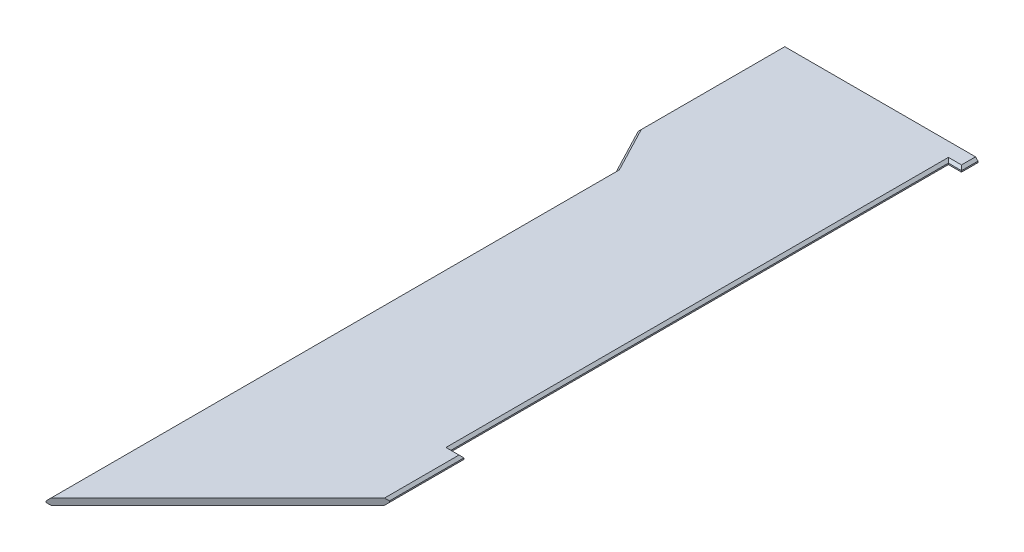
ISO-10303-21;
HEADER;
FILE_DESCRIPTION(('STEP AP214'),'2;1');
FILE_NAME('part.step','',(''),(''),'','','');
FILE_SCHEMA(('AUTOMOTIVE_DESIGN { 1 0 10303 214 1 1 1 1 }'));
ENDSEC;
DATA;
#1=APPLICATION_CONTEXT('core data for automotive mechanical design processes');
#2=APPLICATION_PROTOCOL_DEFINITION('international standard','automotive_design',2000,#1);
#3=PRODUCT_CONTEXT('',#1,'mechanical');
#4=PRODUCT('Part','Part','',(#3));
#5=PRODUCT_RELATED_PRODUCT_CATEGORY('part','',(#4));
#6=PRODUCT_DEFINITION_FORMATION('','',#4);
#7=PRODUCT_DEFINITION_CONTEXT('part definition',#1,'design');
#8=PRODUCT_DEFINITION('design','',#6,#7);
#9=PRODUCT_DEFINITION_SHAPE('','',#8);
#10=(LENGTH_UNIT() NAMED_UNIT(*) SI_UNIT(.MILLI.,.METRE.));
#11=(NAMED_UNIT(*) PLANE_ANGLE_UNIT() SI_UNIT($,.RADIAN.));
#12=(NAMED_UNIT(*) SI_UNIT($,.STERADIAN.) SOLID_ANGLE_UNIT());
#13=UNCERTAINTY_MEASURE_WITH_UNIT(LENGTH_MEASURE(1.E-05),#10,'distance_accuracy_value','');
#14=(GEOMETRIC_REPRESENTATION_CONTEXT(3) GLOBAL_UNCERTAINTY_ASSIGNED_CONTEXT((#13)) GLOBAL_UNIT_ASSIGNED_CONTEXT((#10,
#11,#12)) REPRESENTATION_CONTEXT('',''));
#15=CARTESIAN_POINT('',(0.,0.,0.));
#16=DIRECTION('',(0.,0.,1.));
#17=DIRECTION('',(1.,0.,0.));
#18=AXIS2_PLACEMENT_3D('',#15,#16,#17);
#19=CARTESIAN_POINT('',(552.551731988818,19.05,994.453846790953));
#20=DIRECTION('',(0.,0.,1.));
#21=DIRECTION('',(1.,0.,0.));
#22=AXIS2_PLACEMENT_3D('',#19,#20,#21);
#23=PLANE('',#22);
#24=DIRECTION('',(0.,-1.,0.));
#25=VECTOR('',#24,1.);
#26=CARTESIAN_POINT('',(552.551731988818,19.05,994.453846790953));
#27=LINE('',#26,#25);
#28=CARTESIAN_POINT('',(552.551731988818,4.04999999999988,994.453846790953));
#29=VERTEX_POINT('',#28);
#30=CARTESIAN_POINT('',(552.551731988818,-4.04999999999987,994.453846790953));
#31=VERTEX_POINT('',#30);
#32=EDGE_CURVE('E395',#29,#31,#27,.T.);
#33=ORIENTED_EDGE('',*,*,#32,.T.);
#34=DIRECTION('',(-1.,0.,0.));
#35=VECTOR('',#34,1.);
#36=CARTESIAN_POINT('',(473.351731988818,-4.04999999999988,994.453846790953));
#37=LINE('',#36,#35);
#38=CARTESIAN_POINT('',(473.351731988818,-4.04999999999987,994.453846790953));
#39=VERTEX_POINT('',#38);
#40=EDGE_CURVE('E329',#31,#39,#37,.T.);
#41=ORIENTED_EDGE('',*,*,#40,.T.);
#42=DIRECTION('',(0.,-1.,0.));
#43=VECTOR('',#42,1.);
#44=CARTESIAN_POINT('',(473.351731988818,19.05,994.453846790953));
#45=LINE('',#44,#43);
#46=CARTESIAN_POINT('',(473.351731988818,4.04999999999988,994.453846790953));
#47=VERTEX_POINT('',#46);
#48=EDGE_CURVE('E218',#47,#39,#45,.T.);
#49=ORIENTED_EDGE('',*,*,#48,.F.);
#50=DIRECTION('',(1.,0.,0.));
#51=VECTOR('',#50,1.);
#52=CARTESIAN_POINT('',(552.551731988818,4.04999999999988,994.453846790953));
#53=LINE('',#52,#51);
#54=EDGE_CURVE('E72',#47,#29,#53,.T.);
#55=ORIENTED_EDGE('',*,*,#54,.T.);
#56=EDGE_LOOP('',(#33,#41,#49,#55));
#57=FACE_BOUND('',#56,.T.);
#58=ADVANCED_FACE('F50',(#57),#23,.F.);
#59=CARTESIAN_POINT('',(473.351731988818,19.05,994.453846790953));
#60=DIRECTION('',(-1.,0.,0.));
#61=DIRECTION('',(0.,0.,1.));
#62=AXIS2_PLACEMENT_3D('',#59,#60,#61);
#63=PLANE('',#62);
#64=ORIENTED_EDGE('',*,*,#48,.T.);
#65=DIRECTION('',(0.,0.,-1.));
#66=VECTOR('',#65,1.);
#67=CARTESIAN_POINT('',(473.351731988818,-4.04999999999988,-2017.54615320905));
#68=LINE('',#67,#66);
#69=CARTESIAN_POINT('',(473.351731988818,-4.04999999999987,-2017.54615320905));
#70=VERTEX_POINT('',#69);
#71=EDGE_CURVE('E324',#39,#70,#68,.T.);
#72=ORIENTED_EDGE('',*,*,#71,.T.);
#73=DIRECTION('',(0.,-1.,0.));
#74=VECTOR('',#73,1.);
#75=CARTESIAN_POINT('',(473.351731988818,19.05,-2017.54615320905));
#76=LINE('',#75,#74);
#77=CARTESIAN_POINT('',(473.351731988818,4.04999999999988,-2017.54615320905));
#78=VERTEX_POINT('',#77);
#79=EDGE_CURVE('E227',#78,#70,#76,.T.);
#80=ORIENTED_EDGE('',*,*,#79,.F.);
#81=DIRECTION('',(0.,0.,1.));
#82=VECTOR('',#81,1.);
#83=CARTESIAN_POINT('',(473.351731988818,4.04999999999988,994.453846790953));
#84=LINE('',#83,#82);
#85=EDGE_CURVE('E325',#78,#47,#84,.T.);
#86=ORIENTED_EDGE('',*,*,#85,.T.);
#87=EDGE_LOOP('',(#64,#72,#80,#86));
#88=FACE_BOUND('',#87,.T.);
#89=ADVANCED_FACE('F463',(#88),#63,.F.);
#90=CARTESIAN_POINT('',(473.351731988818,19.05,-2017.54615320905));
#91=DIRECTION('',(0.,0.,-1.));
#92=DIRECTION('',(-1.,0.,0.));
#93=AXIS2_PLACEMENT_3D('',#90,#91,#92);
#94=PLANE('',#93);
#95=ORIENTED_EDGE('',*,*,#79,.T.);
#96=DIRECTION('',(1.,0.,0.));
#97=VECTOR('',#96,1.);
#98=CARTESIAN_POINT('',(552.551731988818,-4.04999999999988,-2017.54615320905));
#99=LINE('',#98,#97);
#100=CARTESIAN_POINT('',(552.551731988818,-4.04999999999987,-2017.54615320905));
#101=VERTEX_POINT('',#100);
#102=EDGE_CURVE('E317',#70,#101,#99,.T.);
#103=ORIENTED_EDGE('',*,*,#102,.T.);
#104=DIRECTION('',(0.,-1.,0.));
#105=VECTOR('',#104,1.);
#106=CARTESIAN_POINT('',(552.551731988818,19.05,-2017.54615320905));
#107=LINE('',#106,#105);
#108=CARTESIAN_POINT('',(552.551731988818,4.04999999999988,-2017.54615320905));
#109=VERTEX_POINT('',#108);
#110=EDGE_CURVE('E413',#109,#101,#107,.T.);
#111=ORIENTED_EDGE('',*,*,#110,.F.);
#112=DIRECTION('',(-1.,0.,0.));
#113=VECTOR('',#112,1.);
#114=CARTESIAN_POINT('',(473.351731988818,4.04999999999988,-2017.54615320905));
#115=LINE('',#114,#113);
#116=EDGE_CURVE('E316',#109,#78,#115,.T.);
#117=ORIENTED_EDGE('',*,*,#116,.T.);
#118=EDGE_LOOP('',(#95,#103,#111,#117));
#119=FACE_BOUND('',#118,.T.);
#120=ADVANCED_FACE('F421',(#119),#94,.F.);
#121=CARTESIAN_POINT('',(552.551731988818,19.05,-2017.54615320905));
#122=DIRECTION('',(-1.,0.,0.));
#123=DIRECTION('',(0.,0.,1.));
#124=AXIS2_PLACEMENT_3D('',#121,#122,#123);
#125=PLANE('',#124);
#126=ORIENTED_EDGE('',*,*,#110,.T.);
#127=DIRECTION('',(0.,0.,-1.));
#128=VECTOR('',#127,1.);
#129=CARTESIAN_POINT('',(552.551731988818,-4.04999999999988,-2117.54615320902));
#130=LINE('',#129,#128);
#131=CARTESIAN_POINT('',(552.551731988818,-4.04999999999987,-2117.54615320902));
#132=VERTEX_POINT('',#131);
#133=EDGE_CURVE('E315',#101,#132,#130,.T.);
#134=ORIENTED_EDGE('',*,*,#133,.T.);
#135=DIRECTION('',(0.,-1.,0.));
#136=VECTOR('',#135,1.);
#137=CARTESIAN_POINT('',(552.551731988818,19.05,-2117.54615320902));
#138=LINE('',#137,#136);
#139=CARTESIAN_POINT('',(552.551731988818,4.04999999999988,-2117.54615320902));
#140=VERTEX_POINT('',#139);
#141=EDGE_CURVE('E412',#140,#132,#138,.T.);
#142=ORIENTED_EDGE('',*,*,#141,.F.);
#143=DIRECTION('',(0.,0.,1.));
#144=VECTOR('',#143,1.);
#145=CARTESIAN_POINT('',(552.551731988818,4.04999999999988,-2017.54615320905));
#146=LINE('',#145,#144);
#147=EDGE_CURVE('E310',#140,#109,#146,.T.);
#148=ORIENTED_EDGE('',*,*,#147,.T.);
#149=EDGE_LOOP('',(#126,#134,#142,#148));
#150=FACE_BOUND('',#149,.T.);
#151=ADVANCED_FACE('F445',(#150),#125,.F.);
#152=CARTESIAN_POINT('',(552.551731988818,19.05,-2117.54615320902));
#153=DIRECTION('',(0.,0.,1.));
#154=DIRECTION('',(1.,0.,0.));
#155=AXIS2_PLACEMENT_3D('',#152,#153,#154);
#156=PLANE('',#155);
#157=DIRECTION('',(-1.,0.,0.));
#158=VECTOR('',#157,1.);
#159=CARTESIAN_POINT('',(552.551731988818,-19.05,-2117.54615320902));
#160=LINE('',#159,#158);
#161=CARTESIAN_POINT('',(537.551731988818,-19.05,-2117.54615320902));
#162=VERTEX_POINT('',#161);
#163=CARTESIAN_POINT('',(-617.248268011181,-19.05,-2117.54615320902));
#164=VERTEX_POINT('',#163);
#165=EDGE_CURVE('E341',#162,#164,#160,.T.);
#166=ORIENTED_EDGE('',*,*,#165,.T.);
#167=DIRECTION('',(-0.707106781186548,0.707106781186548,0.));
#168=VECTOR('',#167,1.);
#169=CARTESIAN_POINT('',(-632.248268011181,-4.04999999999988,-2117.54615320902));
#170=LINE('',#169,#168);
#171=CARTESIAN_POINT('',(-632.248268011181,-4.04999999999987,-2117.54615320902));
#172=VERTEX_POINT('',#171);
#173=EDGE_CURVE('E282',#164,#172,#170,.T.);
#174=ORIENTED_EDGE('',*,*,#173,.T.);
#175=DIRECTION('',(0.,-1.,0.));
#176=VECTOR('',#175,1.);
#177=CARTESIAN_POINT('',(-632.248268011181,19.05,-2117.54615320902));
#178=LINE('',#177,#176);
#179=CARTESIAN_POINT('',(-632.248268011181,4.04999999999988,-2117.54615320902));
#180=VERTEX_POINT('',#179);
#181=EDGE_CURVE('E410',#180,#172,#178,.T.);
#182=ORIENTED_EDGE('',*,*,#181,.F.);
#183=DIRECTION('',(-0.707106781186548,-0.707106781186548,0.));
#184=VECTOR('',#183,1.);
#185=CARTESIAN_POINT('',(-617.248268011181,19.05,-2117.54615320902));
#186=LINE('',#185,#184);
#187=CARTESIAN_POINT('',(-617.248268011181,19.05,-2117.54615320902));
#188=VERTEX_POINT('',#187);
#189=EDGE_CURVE('E279',#180,#188,#186,.F.);
#190=ORIENTED_EDGE('',*,*,#189,.T.);
#191=DIRECTION('',(-1.,0.,0.));
#192=VECTOR('',#191,1.);
#193=CARTESIAN_POINT('',(552.551731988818,19.05,-2117.54615320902));
#194=LINE('',#193,#192);
#195=CARTESIAN_POINT('',(537.551731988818,19.05,-2117.54615320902));
#196=VERTEX_POINT('',#195);
#197=EDGE_CURVE('E446',#196,#188,#194,.T.);
#198=ORIENTED_EDGE('',*,*,#197,.F.);
#199=DIRECTION('',(-0.707106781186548,0.707106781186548,0.));
#200=VECTOR('',#199,1.);
#201=CARTESIAN_POINT('',(537.551731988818,19.05,-2117.54615320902));
#202=LINE('',#201,#200);
#203=EDGE_CURVE('E275',#196,#140,#202,.F.);
#204=ORIENTED_EDGE('',*,*,#203,.T.);
#205=ORIENTED_EDGE('',*,*,#141,.T.);
#206=DIRECTION('',(-0.707106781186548,-0.707106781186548,0.));
#207=VECTOR('',#206,1.);
#208=CARTESIAN_POINT('',(552.551731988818,-4.04999999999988,-2117.54615320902));
#209=LINE('',#208,#207);
#210=EDGE_CURVE('E274',#132,#162,#209,.T.);
#211=ORIENTED_EDGE('',*,*,#210,.T.);
#212=EDGE_LOOP('',(#166,#174,#182,#190,#198,#204,#205,#211));
#213=FACE_BOUND('',#212,.T.);
#214=ADVANCED_FACE('F447',(#213),#156,.F.);
#215=CARTESIAN_POINT('',(-632.248268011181,19.05,-2117.54615320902));
#216=DIRECTION('',(1.,0.,0.));
#217=DIRECTION('',(0.,0.,-1.));
#218=AXIS2_PLACEMENT_3D('',#215,#216,#217);
#219=PLANE('',#218);
#220=ORIENTED_EDGE('',*,*,#181,.T.);
#221=DIRECTION('',(0.,0.,1.));
#222=VECTOR('',#221,1.);
#223=CARTESIAN_POINT('',(-632.248268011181,-4.04999999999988,-1245.01955496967));
#224=LINE('',#223,#222);
#225=CARTESIAN_POINT('',(-632.248268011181,-4.04999999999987,-1245.01955496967));
#226=VERTEX_POINT('',#225);
#227=EDGE_CURVE('E267',#172,#226,#224,.T.);
#228=ORIENTED_EDGE('',*,*,#227,.T.);
#229=DIRECTION('',(0.,-1.,0.));
#230=VECTOR('',#229,1.);
#231=CARTESIAN_POINT('',(-632.248268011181,19.05,-1245.01955496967));
#232=LINE('',#231,#230);
#233=CARTESIAN_POINT('',(-632.248268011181,4.04999999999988,-1245.01955496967));
#234=VERTEX_POINT('',#233);
#235=EDGE_CURVE('E401',#234,#226,#232,.T.);
#236=ORIENTED_EDGE('',*,*,#235,.F.);
#237=DIRECTION('',(0.,0.,-1.));
#238=VECTOR('',#237,1.);
#239=CARTESIAN_POINT('',(-632.248268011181,4.04999999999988,-2117.54615320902));
#240=LINE('',#239,#238);
#241=EDGE_CURVE('E266',#234,#180,#240,.T.);
#242=ORIENTED_EDGE('',*,*,#241,.T.);
#243=EDGE_LOOP('',(#220,#228,#236,#242));
#244=FACE_BOUND('',#243,.T.);
#245=ADVANCED_FACE('F689',(#244),#219,.F.);
#246=CARTESIAN_POINT('',(-487.06076801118,19.05,-967.229254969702));
#247=DIRECTION('',(0.886253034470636,0.,-0.463201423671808));
#248=DIRECTION('',(-0.463201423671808,0.,-0.886253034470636));
#249=AXIS2_PLACEMENT_3D('',#246,#247,#248);
#250=PLANE('',#249);
#251=ORIENTED_EDGE('',*,*,#235,.T.);
#252=DIRECTION('',(0.463201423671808,0.,0.886253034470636));
#253=VECTOR('',#252,1.);
#254=CARTESIAN_POINT('',(-487.06076801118,-4.04999999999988,-967.229254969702));
#255=LINE('',#254,#253);
#256=CARTESIAN_POINT('',(-487.06076801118,-4.04999999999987,-967.229254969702));
#257=VERTEX_POINT('',#256);
#258=EDGE_CURVE('E263',#226,#257,#255,.T.);
#259=ORIENTED_EDGE('',*,*,#258,.T.);
#260=DIRECTION('',(0.,-1.,0.));
#261=VECTOR('',#260,1.);
#262=CARTESIAN_POINT('',(-487.06076801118,19.05,-967.229254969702));
#263=LINE('',#262,#261);
#264=CARTESIAN_POINT('',(-487.06076801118,4.04999999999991,-967.229254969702));
#265=VERTEX_POINT('',#264);
#266=EDGE_CURVE('E211',#265,#257,#263,.T.);
#267=ORIENTED_EDGE('',*,*,#266,.F.);
#268=DIRECTION('',(-0.463201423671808,0.,-0.886253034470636));
#269=VECTOR('',#268,1.);
#270=CARTESIAN_POINT('',(-487.06076801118,4.04999999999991,-967.229254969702));
#271=LINE('',#270,#269);
#272=EDGE_CURVE('E257',#265,#234,#271,.T.);
#273=ORIENTED_EDGE('',*,*,#272,.T.);
#274=EDGE_LOOP('',(#251,#259,#267,#273));
#275=FACE_BOUND('',#274,.T.);
#276=ADVANCED_FACE('F679',(#275),#250,.F.);
#277=CARTESIAN_POINT('',(-487.06076801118,19.05,2485.26634679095));
#278=DIRECTION('',(1.,0.,0.));
#279=DIRECTION('',(0.,0.,-1.));
#280=AXIS2_PLACEMENT_3D('',#277,#278,#279);
#281=PLANE('',#280);
#282=ORIENTED_EDGE('',*,*,#266,.T.);
#283=DIRECTION('',(0.,0.,1.));
#284=VECTOR('',#283,1.);
#285=CARTESIAN_POINT('',(-487.06076801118,-4.04999999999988,2485.26634679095));
#286=LINE('',#285,#284);
#287=CARTESIAN_POINT('',(-487.06076801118,-4.04999999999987,2485.26634679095));
#288=VERTEX_POINT('',#287);
#289=EDGE_CURVE('E207',#257,#288,#286,.T.);
#290=ORIENTED_EDGE('',*,*,#289,.T.);
#291=DIRECTION('',(0.,-1.,0.));
#292=VECTOR('',#291,1.);
#293=CARTESIAN_POINT('',(-487.06076801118,19.05,2485.26634679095));
#294=LINE('',#293,#292);
#295=CARTESIAN_POINT('',(-487.06076801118,4.04999999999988,2485.26634679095));
#296=VERTEX_POINT('',#295);
#297=EDGE_CURVE('E192',#296,#288,#294,.T.);
#298=ORIENTED_EDGE('',*,*,#297,.F.);
#299=DIRECTION('',(0.,0.,-1.));
#300=VECTOR('',#299,1.);
#301=CARTESIAN_POINT('',(-487.06076801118,4.04999999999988,2485.26634679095));
#302=LINE('',#301,#300);
#303=EDGE_CURVE('E206',#296,#265,#302,.T.);
#304=ORIENTED_EDGE('',*,*,#303,.T.);
#305=EDGE_LOOP('',(#282,#290,#298,#304));
#306=FACE_BOUND('',#305,.T.);
#307=ADVANCED_FACE('F202',(#306),#281,.F.);
#308=CARTESIAN_POINT('',(552.551731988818,19.05,1445.65384679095));
#309=DIRECTION('',(-0.707106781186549,0.,-0.707106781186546));
#310=DIRECTION('',(-0.707106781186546,0.,0.707106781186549));
#311=AXIS2_PLACEMENT_3D('',#308,#309,#310);
#312=PLANE('',#311);
#313=ORIENTED_EDGE('',*,*,#297,.T.);
#314=DIRECTION('',(0.577350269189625,-0.577350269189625,-0.577350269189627));
#315=VECTOR('',#314,1.);
#316=CARTESIAN_POINT('',(-487.060768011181,-4.04999999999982,2485.26634679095));
#317=LINE('',#316,#315);
#318=CARTESIAN_POINT('',(-472.06076801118,-19.05,2470.26634679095));
#319=VERTEX_POINT('',#318);
#320=EDGE_CURVE('E200',#288,#319,#317,.T.);
#321=ORIENTED_EDGE('',*,*,#320,.T.);
#322=DIRECTION('',(0.707106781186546,0.,-0.707106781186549));
#323=VECTOR('',#322,1.);
#324=CARTESIAN_POINT('',(552.551731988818,-19.05,1445.65384679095));
#325=LINE('',#324,#323);
#326=CARTESIAN_POINT('',(537.551731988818,-19.05,1460.65384679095));
#327=VERTEX_POINT('',#326);
#328=EDGE_CURVE('E765',#319,#327,#325,.T.);
#329=ORIENTED_EDGE('',*,*,#328,.T.);
#330=DIRECTION('',(0.577350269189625,0.577350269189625,-0.577350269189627));
#331=VECTOR('',#330,1.);
#332=CARTESIAN_POINT('',(552.551731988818,-4.04999999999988,1445.65384679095));
#333=LINE('',#332,#331);
#334=CARTESIAN_POINT('',(552.551731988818,-4.04999999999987,1445.65384679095));
#335=VERTEX_POINT('',#334);
#336=EDGE_CURVE('E199',#327,#335,#333,.T.);
#337=ORIENTED_EDGE('',*,*,#336,.T.);
#338=DIRECTION('',(0.,-1.,0.));
#339=VECTOR('',#338,1.);
#340=CARTESIAN_POINT('',(552.551731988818,19.05,1445.65384679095));
#341=LINE('',#340,#339);
#342=CARTESIAN_POINT('',(552.551731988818,4.04999999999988,1445.65384679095));
#343=VERTEX_POINT('',#342);
#344=EDGE_CURVE('E215',#343,#335,#341,.T.);
#345=ORIENTED_EDGE('',*,*,#344,.F.);
#346=DIRECTION('',(0.577350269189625,-0.577350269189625,-0.577350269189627));
#347=VECTOR('',#346,1.);
#348=CARTESIAN_POINT('',(1024.4363475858,-467.834615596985,973.769231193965));
#349=LINE('',#348,#347);
#350=CARTESIAN_POINT('',(537.551731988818,19.05,1460.65384679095));
#351=VERTEX_POINT('',#350);
#352=EDGE_CURVE('E224',#343,#351,#349,.F.);
#353=ORIENTED_EDGE('',*,*,#352,.T.);
#354=DIRECTION('',(0.707106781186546,0.,-0.707106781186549));
#355=VECTOR('',#354,1.);
#356=CARTESIAN_POINT('',(552.551731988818,19.05,1445.65384679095));
#357=LINE('',#356,#355);
#358=CARTESIAN_POINT('',(-472.06076801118,19.05,2470.26634679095));
#359=VERTEX_POINT('',#358);
#360=EDGE_CURVE('E195',#359,#351,#357,.T.);
#361=ORIENTED_EDGE('',*,*,#360,.F.);
#362=DIRECTION('',(0.577350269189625,0.577350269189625,-0.577350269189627));
#363=VECTOR('',#362,1.);
#364=CARTESIAN_POINT('',(351.361347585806,842.472115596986,1646.84423119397));
#365=LINE('',#364,#363);
#366=EDGE_CURVE('E188',#359,#296,#365,.F.);
#367=ORIENTED_EDGE('',*,*,#366,.T.);
#368=EDGE_LOOP('',(#313,#321,#329,#337,#345,#353,#361,#367));
#369=FACE_BOUND('',#368,.T.);
#370=ADVANCED_FACE('F186',(#369),#312,.F.);
#371=CARTESIAN_POINT('',(552.551731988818,19.05,1445.65384679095));
#372=DIRECTION('',(-1.,0.,0.));
#373=DIRECTION('',(0.,0.,1.));
#374=AXIS2_PLACEMENT_3D('',#371,#372,#373);
#375=PLANE('',#374);
#376=ORIENTED_EDGE('',*,*,#344,.T.);
#377=DIRECTION('',(0.,0.,-1.));
#378=VECTOR('',#377,1.);
#379=CARTESIAN_POINT('',(552.551731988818,-4.04999999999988,994.453846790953));
#380=LINE('',#379,#378);
#381=EDGE_CURVE('E11',#335,#31,#380,.T.);
#382=ORIENTED_EDGE('',*,*,#381,.T.);
#383=ORIENTED_EDGE('',*,*,#32,.F.);
#384=DIRECTION('',(0.,0.,1.));
#385=VECTOR('',#384,1.);
#386=CARTESIAN_POINT('',(552.551731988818,4.04999999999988,1445.65384679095));
#387=LINE('',#386,#385);
#388=EDGE_CURVE('E59',#29,#343,#387,.T.);
#389=ORIENTED_EDGE('',*,*,#388,.T.);
#390=EDGE_LOOP('',(#376,#382,#383,#389));
#391=FACE_BOUND('',#390,.T.);
#392=ADVANCED_FACE('F392',(#391),#375,.F.);
#393=CARTESIAN_POINT('',(0.,19.05,0.));
#394=DIRECTION('',(0.,-1.,0.));
#395=DIRECTION('',(0.,0.,-1.));
#396=AXIS2_PLACEMENT_3D('',#393,#394,#395);
#397=PLANE('',#396);
#398=DIRECTION('',(0.463201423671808,0.,0.886253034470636));
#399=VECTOR('',#398,1.);
#400=CARTESIAN_POINT('',(27.7954513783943,19.05,-14.5273326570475));
#401=LINE('',#400,#399);
#402=CARTESIAN_POINT('',(-617.248268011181,19.05,-1248.70305937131));
#403=VERTEX_POINT('',#402);
#404=CARTESIAN_POINT('',(-472.06076801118,19.05,-970.912759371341));
#405=VERTEX_POINT('',#404);
#406=EDGE_CURVE('E305',#403,#405,#401,.T.);
#407=ORIENTED_EDGE('',*,*,#406,.T.);
#408=DIRECTION('',(0.,0.,1.));
#409=VECTOR('',#408,1.);
#410=CARTESIAN_POINT('',(-472.06076801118,19.05,0.));
#411=LINE('',#410,#409);
#412=EDGE_CURVE('E308',#405,#359,#411,.T.);
#413=ORIENTED_EDGE('',*,*,#412,.T.);
#414=ORIENTED_EDGE('',*,*,#360,.T.);
#415=DIRECTION('',(0.,0.,-1.));
#416=VECTOR('',#415,1.);
#417=CARTESIAN_POINT('',(537.551731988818,19.05,0.));
#418=LINE('',#417,#416);
#419=CARTESIAN_POINT('',(537.551731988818,19.05,1009.45384679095));
#420=VERTEX_POINT('',#419);
#421=EDGE_CURVE('E284',#351,#420,#418,.T.);
#422=ORIENTED_EDGE('',*,*,#421,.T.);
#423=DIRECTION('',(-1.,0.,0.));
#424=VECTOR('',#423,1.);
#425=CARTESIAN_POINT('',(0.,19.05,1009.45384679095));
#426=LINE('',#425,#424);
#427=CARTESIAN_POINT('',(458.351731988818,19.05,1009.45384679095));
#428=VERTEX_POINT('',#427);
#429=EDGE_CURVE('E289',#420,#428,#426,.T.);
#430=ORIENTED_EDGE('',*,*,#429,.T.);
#431=DIRECTION('',(0.,0.,-1.));
#432=VECTOR('',#431,1.);
#433=CARTESIAN_POINT('',(458.351731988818,19.05,0.));
#434=LINE('',#433,#432);
#435=CARTESIAN_POINT('',(458.351731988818,19.05,-2032.54615320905));
#436=VERTEX_POINT('',#435);
#437=EDGE_CURVE('E288',#428,#436,#434,.T.);
#438=ORIENTED_EDGE('',*,*,#437,.T.);
#439=DIRECTION('',(1.,0.,0.));
#440=VECTOR('',#439,1.);
#441=CARTESIAN_POINT('',(0.,19.05,-2032.54615320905));
#442=LINE('',#441,#440);
#443=CARTESIAN_POINT('',(537.551731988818,19.05,-2032.54615320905));
#444=VERTEX_POINT('',#443);
#445=EDGE_CURVE('E291',#436,#444,#442,.T.);
#446=ORIENTED_EDGE('',*,*,#445,.T.);
#447=DIRECTION('',(0.,0.,-1.));
#448=VECTOR('',#447,1.);
#449=CARTESIAN_POINT('',(537.551731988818,19.05,0.));
#450=LINE('',#449,#448);
#451=EDGE_CURVE('E297',#444,#196,#450,.T.);
#452=ORIENTED_EDGE('',*,*,#451,.T.);
#453=ORIENTED_EDGE('',*,*,#197,.T.);
#454=DIRECTION('',(0.,0.,1.));
#455=VECTOR('',#454,1.);
#456=CARTESIAN_POINT('',(-617.248268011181,19.05,0.));
#457=LINE('',#456,#455);
#458=EDGE_CURVE('E296',#188,#403,#457,.T.);
#459=ORIENTED_EDGE('',*,*,#458,.T.);
#460=EDGE_LOOP('',(#407,#413,#414,#422,#430,#438,#446,#452,#453,#459));
#461=FACE_BOUND('',#460,.T.);
#462=ADVANCED_FACE('F453',(#461),#397,.F.);
#463=CARTESIAN_POINT('',(0.,-19.05,0.));
#464=DIRECTION('',(0.,-1.,0.));
#465=DIRECTION('',(0.,0.,-1.));
#466=AXIS2_PLACEMENT_3D('',#463,#464,#465);
#467=PLANE('',#466);
#468=ORIENTED_EDGE('',*,*,#328,.F.);
#469=DIRECTION('',(0.,0.,-1.));
#470=VECTOR('',#469,1.);
#471=CARTESIAN_POINT('',(-472.06076801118,-19.05,-967.229254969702));
#472=LINE('',#471,#470);
#473=CARTESIAN_POINT('',(-472.06076801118,-19.05,-970.912759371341));
#474=VERTEX_POINT('',#473);
#475=EDGE_CURVE('E260',#319,#474,#472,.T.);
#476=ORIENTED_EDGE('',*,*,#475,.T.);
#477=DIRECTION('',(-0.463201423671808,0.,-0.886253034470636));
#478=VECTOR('',#477,1.);
#479=CARTESIAN_POINT('',(-618.954472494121,-19.05,-1251.96757632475));
#480=LINE('',#479,#478);
#481=CARTESIAN_POINT('',(-617.248268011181,-19.05,-1248.70305937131));
#482=VERTEX_POINT('',#481);
#483=EDGE_CURVE('E255',#474,#482,#480,.T.);
#484=ORIENTED_EDGE('',*,*,#483,.T.);
#485=DIRECTION('',(0.,0.,-1.));
#486=VECTOR('',#485,1.);
#487=CARTESIAN_POINT('',(-617.248268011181,-19.05,-2117.54615320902));
#488=LINE('',#487,#486);
#489=EDGE_CURVE('E253',#482,#164,#488,.T.);
#490=ORIENTED_EDGE('',*,*,#489,.T.);
#491=ORIENTED_EDGE('',*,*,#165,.F.);
#492=DIRECTION('',(0.,0.,1.));
#493=VECTOR('',#492,1.);
#494=CARTESIAN_POINT('',(537.551731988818,-19.05,-2017.54615320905));
#495=LINE('',#494,#493);
#496=CARTESIAN_POINT('',(537.551731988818,-19.05,-2032.54615320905));
#497=VERTEX_POINT('',#496);
#498=EDGE_CURVE('E250',#162,#497,#495,.T.);
#499=ORIENTED_EDGE('',*,*,#498,.T.);
#500=DIRECTION('',(-1.,0.,0.));
#501=VECTOR('',#500,1.);
#502=CARTESIAN_POINT('',(473.351731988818,-19.05,-2032.54615320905));
#503=LINE('',#502,#501);
#504=CARTESIAN_POINT('',(458.351731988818,-19.05,-2032.54615320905));
#505=VERTEX_POINT('',#504);
#506=EDGE_CURVE('E241',#497,#505,#503,.T.);
#507=ORIENTED_EDGE('',*,*,#506,.T.);
#508=DIRECTION('',(0.,0.,1.));
#509=VECTOR('',#508,1.);
#510=CARTESIAN_POINT('',(458.351731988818,-19.05,994.453846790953));
#511=LINE('',#510,#509);
#512=CARTESIAN_POINT('',(458.351731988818,-19.05,1009.45384679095));
#513=VERTEX_POINT('',#512);
#514=EDGE_CURVE('E245',#505,#513,#511,.T.);
#515=ORIENTED_EDGE('',*,*,#514,.T.);
#516=DIRECTION('',(1.,0.,0.));
#517=VECTOR('',#516,1.);
#518=CARTESIAN_POINT('',(552.551731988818,-19.05,1009.45384679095));
#519=LINE('',#518,#517);
#520=CARTESIAN_POINT('',(537.551731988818,-19.05,1009.45384679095));
#521=VERTEX_POINT('',#520);
#522=EDGE_CURVE('E239',#513,#521,#519,.T.);
#523=ORIENTED_EDGE('',*,*,#522,.T.);
#524=DIRECTION('',(0.,0.,1.));
#525=VECTOR('',#524,1.);
#526=CARTESIAN_POINT('',(537.551731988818,-19.05,1445.65384679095));
#527=LINE('',#526,#525);
#528=EDGE_CURVE('E237',#521,#327,#527,.T.);
#529=ORIENTED_EDGE('',*,*,#528,.T.);
#530=EDGE_LOOP('',(#468,#476,#484,#490,#491,#499,#507,#515,#523,#529));
#531=FACE_BOUND('',#530,.T.);
#532=ADVANCED_FACE('F471',(#531),#467,.T.);
#533=CARTESIAN_POINT('',(-632.248268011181,-4.04999999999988,-2117.54615320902));
#534=DIRECTION('',(-0.707106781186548,-0.707106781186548,0.));
#535=DIRECTION('',(0.,0.,-1.));
#536=AXIS2_PLACEMENT_3D('',#533,#534,#535);
#537=PLANE('',#536);
#538=ORIENTED_EDGE('',*,*,#173,.F.);
#539=ORIENTED_EDGE('',*,*,#489,.F.);
#540=DIRECTION('',(-0.69668175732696,0.69668175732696,0.171082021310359));
#541=VECTOR('',#540,1.);
#542=CARTESIAN_POINT('',(-528.252064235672,-108.046203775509,-1270.55758659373));
#543=LINE('',#542,#541);
#544=EDGE_CURVE('E339',#226,#482,#543,.F.);
#545=ORIENTED_EDGE('',*,*,#544,.F.);
#546=ORIENTED_EDGE('',*,*,#227,.F.);
#547=EDGE_LOOP('',(#538,#539,#545,#546));
#548=FACE_BOUND('',#547,.T.);
#549=ADVANCED_FACE('F512',(#548),#537,.T.);
#550=CARTESIAN_POINT('',(-487.06076801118,-4.04999999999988,-967.229254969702));
#551=DIRECTION('',(-0.626675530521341,-0.707106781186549,0.327532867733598));
#552=DIRECTION('',(-0.463201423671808,0.,-0.886253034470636));
#553=AXIS2_PLACEMENT_3D('',#550,#551,#552);
#554=PLANE('',#553);
#555=ORIENTED_EDGE('',*,*,#544,.T.);
#556=ORIENTED_EDGE('',*,*,#483,.F.);
#557=DIRECTION('',(-0.69668175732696,0.69668175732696,0.171082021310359));
#558=VECTOR('',#557,1.);
#559=CARTESIAN_POINT('',(-898.56276331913,407.451995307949,-866.177960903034));
#560=LINE('',#559,#558);
#561=EDGE_CURVE('E333',#257,#474,#560,.F.);
#562=ORIENTED_EDGE('',*,*,#561,.F.);
#563=ORIENTED_EDGE('',*,*,#258,.F.);
#564=EDGE_LOOP('',(#555,#556,#562,#563));
#565=FACE_BOUND('',#564,.T.);
#566=ADVANCED_FACE('F504',(#565),#554,.T.);
#567=CARTESIAN_POINT('',(-487.06076801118,-4.04999999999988,2485.26634679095));
#568=DIRECTION('',(-0.707106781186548,-0.707106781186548,0.));
#569=DIRECTION('',(0.,0.,-1.));
#570=AXIS2_PLACEMENT_3D('',#567,#568,#569);
#571=PLANE('',#570);
#572=ORIENTED_EDGE('',*,*,#561,.T.);
#573=ORIENTED_EDGE('',*,*,#475,.F.);
#574=ORIENTED_EDGE('',*,*,#320,.F.);
#575=ORIENTED_EDGE('',*,*,#289,.F.);
#576=EDGE_LOOP('',(#572,#573,#574,#575));
#577=FACE_BOUND('',#576,.T.);
#578=ADVANCED_FACE('F497',(#577),#571,.T.);
#579=CARTESIAN_POINT('',(-617.248268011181,19.05,0.));
#580=DIRECTION('',(0.707106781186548,-0.707106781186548,0.));
#581=DIRECTION('',(0.,0.,1.));
#582=AXIS2_PLACEMENT_3D('',#579,#580,#581);
#583=PLANE('',#582);
#584=ORIENTED_EDGE('',*,*,#189,.F.);
#585=ORIENTED_EDGE('',*,*,#241,.F.);
#586=DIRECTION('',(0.69668175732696,0.69668175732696,-0.171082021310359));
#587=VECTOR('',#586,1.);
#588=CARTESIAN_POINT('',(-766.080840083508,-129.782572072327,-1212.15469708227));
#589=LINE('',#588,#587);
#590=EDGE_CURVE('E336',#403,#234,#589,.F.);
#591=ORIENTED_EDGE('',*,*,#590,.F.);
#592=ORIENTED_EDGE('',*,*,#458,.F.);
#593=EDGE_LOOP('',(#584,#585,#591,#592));
#594=FACE_BOUND('',#593,.T.);
#595=ADVANCED_FACE('F503',(#594),#583,.F.);
#596=CARTESIAN_POINT('',(27.7954513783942,19.05,-14.5273326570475));
#597=DIRECTION('',(0.626675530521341,-0.707106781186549,-0.327532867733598));
#598=DIRECTION('',(0.463201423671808,0.,0.886253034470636));
#599=AXIS2_PLACEMENT_3D('',#596,#597,#598);
#600=PLANE('',#599);
#601=ORIENTED_EDGE('',*,*,#590,.T.);
#602=ORIENTED_EDGE('',*,*,#272,.F.);
#603=DIRECTION('',(0.69668175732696,0.69668175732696,-0.171082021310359));
#604=VECTOR('',#603,1.);
#605=CARTESIAN_POINT('',(-587.78359110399,-96.6728230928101,-942.495057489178));
#606=LINE('',#605,#604);
#607=EDGE_CURVE('E220',#405,#265,#606,.F.);
#608=ORIENTED_EDGE('',*,*,#607,.F.);
#609=ORIENTED_EDGE('',*,*,#406,.F.);
#610=EDGE_LOOP('',(#601,#602,#608,#609));
#611=FACE_BOUND('',#610,.T.);
#612=ADVANCED_FACE('F483',(#611),#600,.F.);
#613=CARTESIAN_POINT('',(-472.06076801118,19.05,0.));
#614=DIRECTION('',(0.707106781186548,-0.707106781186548,0.));
#615=DIRECTION('',(0.,0.,1.));
#616=AXIS2_PLACEMENT_3D('',#613,#614,#615);
#617=PLANE('',#616);
#618=ORIENTED_EDGE('',*,*,#607,.T.);
#619=ORIENTED_EDGE('',*,*,#303,.F.);
#620=ORIENTED_EDGE('',*,*,#366,.F.);
#621=ORIENTED_EDGE('',*,*,#412,.F.);
#622=EDGE_LOOP('',(#618,#619,#620,#621));
#623=FACE_BOUND('',#622,.T.);
#624=ADVANCED_FACE('F214',(#623),#617,.F.);
#625=CARTESIAN_POINT('',(552.551731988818,-4.04999999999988,1445.65384679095));
#626=DIRECTION('',(0.707106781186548,-0.707106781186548,0.));
#627=DIRECTION('',(0.,0.,1.));
#628=AXIS2_PLACEMENT_3D('',#625,#626,#627);
#629=PLANE('',#628);
#630=ORIENTED_EDGE('',*,*,#336,.F.);
#631=ORIENTED_EDGE('',*,*,#528,.F.);
#632=DIRECTION('',(0.577350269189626,0.577350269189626,-0.577350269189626));
#633=VECTOR('',#632,1.);
#634=CARTESIAN_POINT('',(402.151731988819,-154.45,1144.85384679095));
#635=LINE('',#634,#633);
#636=EDGE_CURVE('E350',#31,#521,#635,.F.);
#637=ORIENTED_EDGE('',*,*,#636,.F.);
#638=ORIENTED_EDGE('',*,*,#381,.F.);
#639=EDGE_LOOP('',(#630,#631,#637,#638));
#640=FACE_BOUND('',#639,.T.);
#641=ADVANCED_FACE('F474',(#640),#629,.T.);
#642=CARTESIAN_POINT('',(552.551731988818,-4.04999999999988,994.453846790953));
#643=DIRECTION('',(0.,-0.707106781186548,-0.707106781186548));
#644=DIRECTION('',(1.,0.,0.));
#645=AXIS2_PLACEMENT_3D('',#642,#643,#644);
#646=PLANE('',#645);
#647=ORIENTED_EDGE('',*,*,#636,.T.);
#648=ORIENTED_EDGE('',*,*,#522,.F.);
#649=DIRECTION('',(0.577350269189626,0.577350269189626,-0.577350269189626));
#650=VECTOR('',#649,1.);
#651=CARTESIAN_POINT('',(473.351731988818,-4.04999999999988,994.453846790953));
#652=LINE('',#651,#650);
#653=EDGE_CURVE('E356',#39,#513,#652,.F.);
#654=ORIENTED_EDGE('',*,*,#653,.F.);
#655=ORIENTED_EDGE('',*,*,#40,.F.);
#656=EDGE_LOOP('',(#647,#648,#654,#655));
#657=FACE_BOUND('',#656,.T.);
#658=ADVANCED_FACE('F470',(#657),#646,.T.);
#659=CARTESIAN_POINT('',(473.351731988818,-4.04999999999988,994.453846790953));
#660=DIRECTION('',(0.707106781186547,-0.707106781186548,0.));
#661=DIRECTION('',(0.,0.,1.));
#662=AXIS2_PLACEMENT_3D('',#659,#660,#661);
#663=PLANE('',#662);
#664=ORIENTED_EDGE('',*,*,#653,.T.);
#665=ORIENTED_EDGE('',*,*,#514,.F.);
#666=DIRECTION('',(0.577350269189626,0.577350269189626,0.577350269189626));
#667=VECTOR('',#666,1.);
#668=CARTESIAN_POINT('',(473.351731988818,-4.04999999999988,-2017.54615320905));
#669=LINE('',#668,#667);
#670=EDGE_CURVE('E351',#70,#505,#669,.F.);
#671=ORIENTED_EDGE('',*,*,#670,.F.);
#672=ORIENTED_EDGE('',*,*,#71,.F.);
#673=EDGE_LOOP('',(#664,#665,#671,#672));
#674=FACE_BOUND('',#673,.T.);
#675=ADVANCED_FACE('F431',(#674),#663,.T.);
#676=CARTESIAN_POINT('',(473.351731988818,-4.04999999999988,-2017.54615320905));
#677=DIRECTION('',(0.,-0.707106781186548,0.707106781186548));
#678=DIRECTION('',(-1.,0.,0.));
#679=AXIS2_PLACEMENT_3D('',#676,#677,#678);
#680=PLANE('',#679);
#681=ORIENTED_EDGE('',*,*,#670,.T.);
#682=ORIENTED_EDGE('',*,*,#506,.F.);
#683=DIRECTION('',(0.577350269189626,0.577350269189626,0.577350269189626));
#684=VECTOR('',#683,1.);
#685=CARTESIAN_POINT('',(526.151731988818,-30.45,-2043.94615320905));
#686=LINE('',#685,#684);
#687=EDGE_CURVE('E352',#101,#497,#686,.F.);
#688=ORIENTED_EDGE('',*,*,#687,.F.);
#689=ORIENTED_EDGE('',*,*,#102,.F.);
#690=EDGE_LOOP('',(#681,#682,#688,#689));
#691=FACE_BOUND('',#690,.T.);
#692=ADVANCED_FACE('F434',(#691),#680,.T.);
#693=CARTESIAN_POINT('',(552.551731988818,-4.04999999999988,-2017.54615320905));
#694=DIRECTION('',(0.707106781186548,-0.707106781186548,0.));
#695=DIRECTION('',(0.,0.,1.));
#696=AXIS2_PLACEMENT_3D('',#693,#694,#695);
#697=PLANE('',#696);
#698=ORIENTED_EDGE('',*,*,#687,.T.);
#699=ORIENTED_EDGE('',*,*,#498,.F.);
#700=ORIENTED_EDGE('',*,*,#210,.F.);
#701=ORIENTED_EDGE('',*,*,#133,.F.);
#702=EDGE_LOOP('',(#698,#699,#700,#701));
#703=FACE_BOUND('',#702,.T.);
#704=ADVANCED_FACE('F438',(#703),#697,.T.);
#705=CARTESIAN_POINT('',(537.551731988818,19.05,0.));
#706=DIRECTION('',(-0.707106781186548,-0.707106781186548,0.));
#707=DIRECTION('',(0.,0.,-1.));
#708=AXIS2_PLACEMENT_3D('',#705,#706,#707);
#709=PLANE('',#708);
#710=ORIENTED_EDGE('',*,*,#352,.F.);
#711=ORIENTED_EDGE('',*,*,#388,.F.);
#712=DIRECTION('',(-0.577350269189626,0.577350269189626,0.577350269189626));
#713=VECTOR('',#712,1.);
#714=CARTESIAN_POINT('',(874.036347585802,-317.434615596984,672.969231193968));
#715=LINE('',#714,#713);
#716=EDGE_CURVE('E55',#420,#29,#715,.F.);
#717=ORIENTED_EDGE('',*,*,#716,.F.);
#718=ORIENTED_EDGE('',*,*,#421,.F.);
#719=EDGE_LOOP('',(#710,#711,#717,#718));
#720=FACE_BOUND('',#719,.T.);
#721=ADVANCED_FACE('F49',(#720),#709,.F.);
#722=CARTESIAN_POINT('',(0.,19.05,1009.45384679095));
#723=DIRECTION('',(0.,-0.707106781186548,0.707106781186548));
#724=DIRECTION('',(-1.,0.,0.));
#725=AXIS2_PLACEMENT_3D('',#722,#723,#724);
#726=PLANE('',#725);
#727=ORIENTED_EDGE('',*,*,#716,.T.);
#728=ORIENTED_EDGE('',*,*,#54,.F.);
#729=DIRECTION('',(-0.577350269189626,0.577350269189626,0.577350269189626));
#730=VECTOR('',#729,1.);
#731=CARTESIAN_POINT('',(794.836347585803,-317.434615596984,672.969231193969));
#732=LINE('',#731,#730);
#733=EDGE_CURVE('E373',#428,#47,#732,.F.);
#734=ORIENTED_EDGE('',*,*,#733,.F.);
#735=ORIENTED_EDGE('',*,*,#429,.F.);
#736=EDGE_LOOP('',(#727,#728,#734,#735));
#737=FACE_BOUND('',#736,.T.);
#738=ADVANCED_FACE('F384',(#737),#726,.F.);
#739=CARTESIAN_POINT('',(458.351731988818,19.05,0.));
#740=DIRECTION('',(-0.707106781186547,-0.707106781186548,0.));
#741=DIRECTION('',(0.,0.,-1.));
#742=AXIS2_PLACEMENT_3D('',#739,#740,#741);
#743=PLANE('',#742);
#744=ORIENTED_EDGE('',*,*,#733,.T.);
#745=ORIENTED_EDGE('',*,*,#85,.F.);
#746=DIRECTION('',(-0.577350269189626,0.577350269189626,-0.577350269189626));
#747=VECTOR('',#746,1.);
#748=CARTESIAN_POINT('',(305.567821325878,171.833910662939,-2185.33006387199));
#749=LINE('',#748,#747);
#750=EDGE_CURVE('E367',#436,#78,#749,.F.);
#751=ORIENTED_EDGE('',*,*,#750,.F.);
#752=ORIENTED_EDGE('',*,*,#437,.F.);
#753=EDGE_LOOP('',(#744,#745,#751,#752));
#754=FACE_BOUND('',#753,.T.);
#755=ADVANCED_FACE('F465',(#754),#743,.F.);
#756=CARTESIAN_POINT('',(0.,19.05,-2032.54615320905));
#757=DIRECTION('',(0.,-0.707106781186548,-0.707106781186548));
#758=DIRECTION('',(1.,0.,0.));
#759=AXIS2_PLACEMENT_3D('',#756,#757,#758);
#760=PLANE('',#759);
#761=ORIENTED_EDGE('',*,*,#750,.T.);
#762=ORIENTED_EDGE('',*,*,#116,.F.);
#763=DIRECTION('',(-0.577350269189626,0.577350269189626,-0.577350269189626));
#764=VECTOR('',#763,1.);
#765=CARTESIAN_POINT('',(358.367821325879,198.233910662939,-2211.73006387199));
#766=LINE('',#765,#764);
#767=EDGE_CURVE('E368',#444,#109,#766,.F.);
#768=ORIENTED_EDGE('',*,*,#767,.F.);
#769=ORIENTED_EDGE('',*,*,#445,.F.);
#770=EDGE_LOOP('',(#761,#762,#768,#769));
#771=FACE_BOUND('',#770,.T.);
#772=ADVANCED_FACE('F462',(#771),#760,.F.);
#773=CARTESIAN_POINT('',(537.551731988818,19.05,0.));
#774=DIRECTION('',(-0.707106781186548,-0.707106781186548,0.));
#775=DIRECTION('',(0.,0.,-1.));
#776=AXIS2_PLACEMENT_3D('',#773,#774,#775);
#777=PLANE('',#776);
#778=ORIENTED_EDGE('',*,*,#767,.T.);
#779=ORIENTED_EDGE('',*,*,#147,.F.);
#780=ORIENTED_EDGE('',*,*,#203,.F.);
#781=ORIENTED_EDGE('',*,*,#451,.F.);
#782=EDGE_LOOP('',(#778,#779,#780,#781));
#783=FACE_BOUND('',#782,.T.);
#784=ADVANCED_FACE('F455',(#783),#777,.F.);
#785=CLOSED_SHELL('',(#58,#89,#120,#151,#214,#245,#276,#307,#370,#392,#462,#532,#549,#566,#578,
#595,#612,#624,#641,#658,#675,#692,#704,#721,#738,#755,#772,#784));
#786=MANIFOLD_SOLID_BREP('B2',#785);
#787=ADVANCED_BREP_SHAPE_REPRESENTATION('',(#18,#786),#14);
#788=SHAPE_DEFINITION_REPRESENTATION(#9,#787);
ENDSEC;
END-ISO-10303-21;
